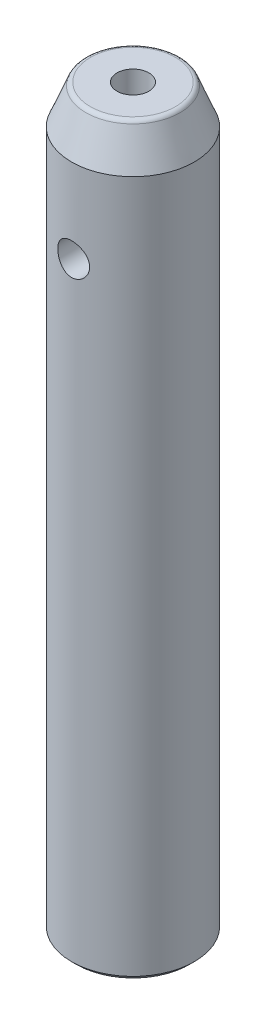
ISO-10303-21;
HEADER;
FILE_DESCRIPTION(('STEP AP214'),'2;1');
FILE_NAME('part.step','',(''),(''),'','','');
FILE_SCHEMA(('AUTOMOTIVE_DESIGN { 1 0 10303 214 1 1 1 1 }'));
ENDSEC;
DATA;
#1=APPLICATION_CONTEXT('core data for automotive mechanical design processes');
#2=APPLICATION_PROTOCOL_DEFINITION('international standard','automotive_design',2000,#1);
#3=PRODUCT_CONTEXT('',#1,'mechanical');
#4=PRODUCT('Part','Part','',(#3));
#5=PRODUCT_RELATED_PRODUCT_CATEGORY('part','',(#4));
#6=PRODUCT_DEFINITION_FORMATION('','',#4);
#7=PRODUCT_DEFINITION_CONTEXT('part definition',#1,'design');
#8=PRODUCT_DEFINITION('design','',#6,#7);
#9=PRODUCT_DEFINITION_SHAPE('','',#8);
#10=(LENGTH_UNIT() NAMED_UNIT(*) SI_UNIT(.MILLI.,.METRE.));
#11=(NAMED_UNIT(*) PLANE_ANGLE_UNIT() SI_UNIT($,.RADIAN.));
#12=(NAMED_UNIT(*) SI_UNIT($,.STERADIAN.) SOLID_ANGLE_UNIT());
#13=UNCERTAINTY_MEASURE_WITH_UNIT(LENGTH_MEASURE(1.E-05),#10,'distance_accuracy_value','');
#14=(GEOMETRIC_REPRESENTATION_CONTEXT(3) GLOBAL_UNCERTAINTY_ASSIGNED_CONTEXT((#13)) GLOBAL_UNIT_ASSIGNED_CONTEXT((#10,
#11,#12)) REPRESENTATION_CONTEXT('',''));
#15=CARTESIAN_POINT('',(0.,0.,0.));
#16=DIRECTION('',(0.,0.,1.));
#17=DIRECTION('',(1.,0.,0.));
#18=AXIS2_PLACEMENT_3D('',#15,#16,#17);
#19=CARTESIAN_POINT('',(0.,76.2,0.));
#20=DIRECTION('',(0.,-1.,0.));
#21=DIRECTION('',(0.,0.,-1.));
#22=AXIS2_PLACEMENT_3D('',#19,#20,#21);
#23=CYLINDRICAL_SURFACE('',#22,6.35);
#24=CARTESIAN_POINT('',(0.,65.15,-6.35));
#25=CARTESIAN_POINT('',(-0.0910448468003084,65.1499976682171,-6.34999855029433));
#26=CARTESIAN_POINT('',(-0.182115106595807,65.1424390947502,-6.34802256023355));
#27=CARTESIAN_POINT('',(-0.361637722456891,65.112454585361,-6.34033166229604));
#28=CARTESIAN_POINT('',(-0.450088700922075,65.090020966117,-6.33461482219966));
#29=CARTESIAN_POINT('',(-0.621755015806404,65.0310607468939,-6.32007407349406));
#30=CARTESIAN_POINT('',(-0.704976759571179,64.9945518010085,-6.3112540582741));
#31=CARTESIAN_POINT('',(-0.864115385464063,64.9085413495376,-6.29144207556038));
#32=CARTESIAN_POINT('',(-0.940031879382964,64.8590391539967,-6.28044999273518));
#33=CARTESIAN_POINT('',(-1.08408361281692,64.7472915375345,-6.25721162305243));
#34=CARTESIAN_POINT('',(-1.1520343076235,64.6848124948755,-6.2449447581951));
#35=CARTESIAN_POINT('',(-1.27662045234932,64.5493844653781,-6.22067339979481));
#36=CARTESIAN_POINT('',(-1.33325452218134,64.4764342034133,-6.20866893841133));
#37=CARTESIAN_POINT('',(-1.43448627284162,64.3206782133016,-6.18607236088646));
#38=CARTESIAN_POINT('',(-1.47887409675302,64.2377319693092,-6.17550627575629));
#39=CARTESIAN_POINT('',(-1.55300255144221,64.0652354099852,-6.15728432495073));
#40=CARTESIAN_POINT('',(-1.58274573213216,63.9756862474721,-6.14962795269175));
#41=CARTESIAN_POINT('',(-1.62610440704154,63.7945636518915,-6.13830437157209));
#42=CARTESIAN_POINT('',(-1.6400533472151,63.7030753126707,-6.13455482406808));
#43=CARTESIAN_POINT('',(-1.65246676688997,63.5189861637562,-6.13122323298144));
#44=CARTESIAN_POINT('',(-1.65093398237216,63.4263855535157,-6.13164045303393));
#45=CARTESIAN_POINT('',(-1.63269273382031,63.2452833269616,-6.13652142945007));
#46=CARTESIAN_POINT('',(-1.61638516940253,63.1567379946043,-6.14087828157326));
#47=CARTESIAN_POINT('',(-1.56969829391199,62.9836852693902,-6.15297677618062));
#48=CARTESIAN_POINT('',(-1.53931790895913,62.8991781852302,-6.16071867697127));
#49=CARTESIAN_POINT('',(-1.46501490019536,62.735543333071,-6.17881066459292));
#50=CARTESIAN_POINT('',(-1.42094967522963,62.6564834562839,-6.18918799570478));
#51=CARTESIAN_POINT('',(-1.32062741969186,62.5067381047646,-6.2113666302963));
#52=CARTESIAN_POINT('',(-1.26436809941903,62.4360542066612,-6.22316820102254));
#53=CARTESIAN_POINT('',(-1.13919365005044,62.3027738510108,-6.2473127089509));
#54=CARTESIAN_POINT('',(-1.06994116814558,62.240494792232,-6.2596611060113));
#55=CARTESIAN_POINT('',(-0.921825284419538,62.1283711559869,-6.28318013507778));
#56=CARTESIAN_POINT('',(-0.842961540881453,62.0785270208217,-6.294350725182));
#57=CARTESIAN_POINT('',(-0.677386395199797,61.9925581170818,-6.31431860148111));
#58=CARTESIAN_POINT('',(-0.590645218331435,61.9564883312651,-6.32310633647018));
#59=CARTESIAN_POINT('',(-0.412050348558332,61.8995330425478,-6.33724917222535));
#60=CARTESIAN_POINT('',(-0.320197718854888,61.8786443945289,-6.34260498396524));
#61=CARTESIAN_POINT('',(-0.136698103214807,61.8531370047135,-6.34917395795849));
#62=CARTESIAN_POINT('',(-0.0451149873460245,61.8480864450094,-6.35049704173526));
#63=CARTESIAN_POINT('',(0.137588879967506,61.853209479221,-6.34916628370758));
#64=CARTESIAN_POINT('',(0.22870967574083,61.8633815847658,-6.34651283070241));
#65=CARTESIAN_POINT('',(0.406378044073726,61.8983062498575,-6.33759791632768));
#66=CARTESIAN_POINT('',(0.492975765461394,61.9228201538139,-6.33139554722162));
#67=CARTESIAN_POINT('',(0.660823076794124,61.985457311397,-6.31608436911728));
#68=CARTESIAN_POINT('',(0.742072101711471,62.0235820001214,-6.30697525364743));
#69=CARTESIAN_POINT('',(0.898610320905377,62.1131743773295,-6.28660102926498));
#70=CARTESIAN_POINT('',(0.973758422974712,62.1648798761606,-6.27529854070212));
#71=CARTESIAN_POINT('',(1.11446374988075,62.2798651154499,-6.25184511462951));
#72=CARTESIAN_POINT('',(1.18001917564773,62.3431470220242,-6.23969401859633));
#73=CARTESIAN_POINT('',(1.30148131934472,62.4814998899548,-6.21551205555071));
#74=CARTESIAN_POINT('',(1.3570840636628,62.5568402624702,-6.20349303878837));
#75=CARTESIAN_POINT('',(1.45486120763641,62.7160338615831,-6.18129455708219));
#76=CARTESIAN_POINT('',(1.49703618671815,62.7998867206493,-6.17111501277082));
#77=CARTESIAN_POINT('',(1.56644342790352,62.9732909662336,-6.1538633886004));
#78=CARTESIAN_POINT('',(1.59376344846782,63.0628053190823,-6.14677310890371));
#79=CARTESIAN_POINT('',(1.63290364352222,63.2453713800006,-6.13649272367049));
#80=CARTESIAN_POINT('',(1.64472753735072,63.3384222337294,-6.13330168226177));
#81=CARTESIAN_POINT('',(1.65233394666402,63.5223158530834,-6.13125643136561));
#82=CARTESIAN_POINT('',(1.64860385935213,63.6131373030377,-6.13227044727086));
#83=CARTESIAN_POINT('',(1.62633248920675,63.7928083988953,-6.13821413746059));
#84=CARTESIAN_POINT('',(1.60779155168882,63.8816580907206,-6.14314372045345));
#85=CARTESIAN_POINT('',(1.55670066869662,64.0542849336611,-6.15628671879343));
#86=CARTESIAN_POINT('',(1.52424906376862,64.1380930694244,-6.16447705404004));
#87=CARTESIAN_POINT('',(1.44633487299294,64.2991372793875,-6.18322034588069));
#88=CARTESIAN_POINT('',(1.40087034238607,64.3763723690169,-6.1937736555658));
#89=CARTESIAN_POINT('',(1.2967225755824,64.5244165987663,-6.2164235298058));
#90=CARTESIAN_POINT('',(1.23770439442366,64.5949847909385,-6.22855507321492));
#91=CARTESIAN_POINT('',(1.10876820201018,64.7253743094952,-6.25279366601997));
#92=CARTESIAN_POINT('',(1.03884757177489,64.7851930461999,-6.26490070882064));
#93=CARTESIAN_POINT('',(0.888403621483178,64.8935578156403,-6.28801547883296));
#94=CARTESIAN_POINT('',(0.807696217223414,64.9418544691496,-6.29899637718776));
#95=CARTESIAN_POINT('',(0.639026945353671,65.0241179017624,-6.31833266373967));
#96=CARTESIAN_POINT('',(0.551070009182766,65.0580943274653,-6.32668981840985));
#97=CARTESIAN_POINT('',(0.38613908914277,65.1060647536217,-6.33869137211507));
#98=CARTESIAN_POINT('',(0.309908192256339,65.1225033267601,-6.3429019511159));
#99=CARTESIAN_POINT('',(0.155790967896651,65.1444714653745,-6.34855676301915));
#100=CARTESIAN_POINT('',(0.0779047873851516,65.150001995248,-6.35000124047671));
#101=CARTESIAN_POINT('',(0.,65.15,-6.35));
#102=B_SPLINE_CURVE_WITH_KNOTS('',3,(#24,#25,#26,#27,#28,#29,#30,#31,#32,#33,#34,#35,#36,#37,
#38,#39,#40,#41,#42,#43,#44,#45,#46,#47,#48,#49,#50,#51,#52,#53,#54,#55,#56,#57,#58,#59,#60,#61,
#62,#63,#64,#65,#66,#67,#68,#69,#70,#71,#72,#73,#74,#75,#76,#77,#78,#79,#80,#81,#82,#83,#84,#85,
#86,#87,#88,#89,#90,#91,#92,#93,#94,#95,#96,#97,#98,#99,#100,#101),.UNSPECIFIED.,.T.,.F.,(4,2,2,
2,2,2,2,2,2,2,2,2,2,2,2,2,2,2,2,2,2,2,2,2,2,2,2,2,2,2,2,2,2,2,2,2,2,2,4),(0.,0.272848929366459,
0.545838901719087,0.818487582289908,1.09115074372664,1.36923066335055,1.64734447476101,
1.92996381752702,2.2125339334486,2.48902023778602,2.76545768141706,3.03461179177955,
3.30378644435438,3.57586585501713,3.847996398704,4.12853593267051,4.4090854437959,
4.69074339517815,4.97234297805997,5.24619498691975,5.52002022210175,5.7894134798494,
6.05883515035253,6.33333182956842,6.60787992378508,6.88975050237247,7.17160891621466,
7.45178358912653,7.73189100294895,8.00328805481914,8.27467877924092,8.54418177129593,
8.81372506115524,9.09082731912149,9.36799624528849,9.65070850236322,9.93323000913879,
10.1667206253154,10.4001905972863),.UNSPECIFIED.);
#103=CARTESIAN_POINT('',(0.,65.15,-6.35));
#104=VERTEX_POINT('',#103);
#105=EDGE_CURVE('E71',#104,#104,#102,.T.);
#106=ORIENTED_EDGE('',*,*,#105,.T.);
#107=EDGE_LOOP('',(#106));
#108=FACE_BOUND('',#107,.T.);
#109=CARTESIAN_POINT('',(1.65,63.5,6.13188388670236));
#110=CARTESIAN_POINT('',(1.64999763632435,63.4090136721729,6.13188553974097));
#111=CARTESIAN_POINT('',(1.64244844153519,63.3180018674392,6.1339311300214));
#112=CARTESIAN_POINT('',(1.61250455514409,63.1386004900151,6.14186949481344));
#113=CARTESIAN_POINT('',(1.5901019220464,63.0502123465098,6.14776432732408));
#114=CARTESIAN_POINT('',(1.53123224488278,62.8786793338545,6.16268948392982));
#115=CARTESIAN_POINT('',(1.49478429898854,62.7955275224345,6.17171554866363));
#116=CARTESIAN_POINT('',(1.40891777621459,62.6365074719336,6.19188078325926));
#117=CARTESIAN_POINT('',(1.35949838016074,62.560639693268,6.20302008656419));
#118=CARTESIAN_POINT('',(1.24783688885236,62.41653888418,6.22645310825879));
#119=CARTESIAN_POINT('',(1.18534252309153,62.3485044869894,6.23876646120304));
#120=CARTESIAN_POINT('',(1.04984797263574,62.2237551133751,6.26299035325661));
#121=CARTESIAN_POINT('',(0.97684674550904,62.1670412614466,6.27490085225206));
#122=CARTESIAN_POINT('',(0.821040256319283,62.0657210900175,6.29719537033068));
#123=CARTESIAN_POINT('',(0.738103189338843,62.0213112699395,6.30755352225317));
#124=CARTESIAN_POINT('',(0.565626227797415,61.9471396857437,6.3253515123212));
#125=CARTESIAN_POINT('',(0.47608739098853,61.9173755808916,6.33279181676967));
#126=CARTESIAN_POINT('',(0.295020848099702,61.8739804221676,6.34377696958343));
#127=CARTESIAN_POINT('',(0.203579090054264,61.8600117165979,6.34740322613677));
#128=CARTESIAN_POINT('',(0.0195829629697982,61.8475425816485,6.35063594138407));
#129=CARTESIAN_POINT('',(-0.0729712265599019,61.8490396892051,6.35024304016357));
#130=CARTESIAN_POINT('',(-0.254218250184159,61.8672197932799,6.34554175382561));
#131=CARTESIAN_POINT('',(-0.342950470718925,61.8835381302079,6.34132739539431));
#132=CARTESIAN_POINT('',(-0.51637116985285,61.9303095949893,6.32956706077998));
#133=CARTESIAN_POINT('',(-0.601059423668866,61.9607635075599,6.32202089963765));
#134=CARTESIAN_POINT('',(-0.764931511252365,62.0352275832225,6.30430356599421));
#135=CARTESIAN_POINT('',(-0.844054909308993,62.0793646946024,6.29410796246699));
#136=CARTESIAN_POINT('',(-0.993897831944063,62.179845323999,6.27219339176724));
#137=CARTESIAN_POINT('',(-1.0646157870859,62.2361911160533,6.26047414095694));
#138=CARTESIAN_POINT('',(-1.1978163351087,62.3614334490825,6.23638166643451));
#139=CARTESIAN_POINT('',(-1.25999831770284,62.430648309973,6.22399933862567));
#140=CARTESIAN_POINT('',(-1.37194316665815,62.5786523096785,6.20028671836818));
#141=CARTESIAN_POINT('',(-1.42170535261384,62.6574419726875,6.1889564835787));
#142=CARTESIAN_POINT('',(-1.50761156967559,62.822984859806,6.16859596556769));
#143=CARTESIAN_POINT('',(-1.54367780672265,62.9097801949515,6.15957891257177));
#144=CARTESIAN_POINT('',(-1.60061006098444,63.0884943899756,6.14503216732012));
#145=CARTESIAN_POINT('',(-1.62147963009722,63.18041204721,6.139501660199));
#146=CARTESIAN_POINT('',(-1.64691605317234,63.3639600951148,6.13272673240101));
#147=CARTESIAN_POINT('',(-1.65192968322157,63.4555243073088,6.13136488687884));
#148=CARTESIAN_POINT('',(-1.6467396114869,63.6381820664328,6.13276088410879));
#149=CARTESIAN_POINT('',(-1.63653743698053,63.72927565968,6.13551831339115));
#150=CARTESIAN_POINT('',(-1.60159835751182,63.9067111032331,6.14472911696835));
#151=CARTESIAN_POINT('',(-1.57712648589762,63.9931089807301,6.15111504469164));
#152=CARTESIAN_POINT('',(-1.51463894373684,64.1605749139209,6.16679819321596));
#153=CARTESIAN_POINT('',(-1.47662157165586,64.2416422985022,6.17609577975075));
#154=CARTESIAN_POINT('',(-1.38720350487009,64.3980251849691,6.19679824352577));
#155=CARTESIAN_POINT('',(-1.33553846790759,64.4731841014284,6.20824328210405));
#156=CARTESIAN_POINT('',(-1.22062204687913,64.6139295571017,6.23185492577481));
#157=CARTESIAN_POINT('',(-1.15736859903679,64.6795143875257,6.24402165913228));
#158=CARTESIAN_POINT('',(-1.01901104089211,64.8010858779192,6.26810744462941));
#159=CARTESIAN_POINT('',(-0.94363079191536,64.8567620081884,6.28001069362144));
#160=CARTESIAN_POINT('',(-0.784333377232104,64.9546682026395,6.3018866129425));
#161=CARTESIAN_POINT('',(-0.700416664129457,64.9968989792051,6.31185938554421));
#162=CARTESIAN_POINT('',(-0.52701661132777,65.0663359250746,6.3286868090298));
#163=CARTESIAN_POINT('',(-0.437579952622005,65.0936528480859,6.33556437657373));
#164=CARTESIAN_POINT('',(-0.255181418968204,65.1328129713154,6.34552712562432));
#165=CARTESIAN_POINT('',(-0.162220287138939,65.1446594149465,6.34861310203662));
#166=CARTESIAN_POINT('',(0.0216806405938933,65.1523476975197,6.35060954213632));
#167=CARTESIAN_POINT('',(0.112600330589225,65.148646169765,6.34963914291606));
#168=CARTESIAN_POINT('',(0.292475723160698,65.126397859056,6.34389911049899));
#169=CARTESIAN_POINT('',(0.381431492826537,65.1078515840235,6.33912960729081));
#170=CARTESIAN_POINT('',(0.554334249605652,65.0566930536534,6.32634877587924));
#171=CARTESIAN_POINT('',(0.638309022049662,65.0241692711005,6.31835785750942));
#172=CARTESIAN_POINT('',(0.799657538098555,64.9460583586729,6.29997214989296));
#173=CARTESIAN_POINT('',(0.877030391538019,64.900469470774,6.2895770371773));
#174=CARTESIAN_POINT('',(1.02512119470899,64.7961626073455,6.26716709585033));
#175=CARTESIAN_POINT('',(1.09561856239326,64.7371389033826,6.25511766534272));
#176=CARTESIAN_POINT('',(1.22586275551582,64.6082234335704,6.23090349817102));
#177=CARTESIAN_POINT('',(1.28560679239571,64.5383288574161,6.21873873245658));
#178=CARTESIAN_POINT('',(1.39386165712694,64.3879245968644,6.19538429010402));
#179=CARTESIAN_POINT('',(1.44211599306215,64.3072260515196,6.18421983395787));
#180=CARTESIAN_POINT('',(1.52430254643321,64.1385820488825,6.16447892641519));
#181=CARTESIAN_POINT('',(1.55824457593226,64.0506416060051,6.15590070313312));
#182=CARTESIAN_POINT('',(1.60614388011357,63.8857937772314,6.14355741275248));
#183=CARTESIAN_POINT('',(1.62255248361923,63.8096329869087,6.13921421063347));
#184=CARTESIAN_POINT('',(1.64448100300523,63.6556542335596,6.13337688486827));
#185=CARTESIAN_POINT('',(1.6500020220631,63.5778364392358,6.13188247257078));
#186=CARTESIAN_POINT('',(1.65,63.5,6.13188388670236));
#187=B_SPLINE_CURVE_WITH_KNOTS('',3,(#109,#110,#111,#112,#113,#114,#115,#116,#117,#118,#119,
#120,#121,#122,#123,#124,#125,#126,#127,#128,#129,#130,#131,#132,#133,#134,#135,#136,#137,#138,
#139,#140,#141,#142,#143,#144,#145,#146,#147,#148,#149,#150,#151,#152,#153,#154,#155,#156,#157,
#158,#159,#160,#161,#162,#163,#164,#165,#166,#167,#168,#169,#170,#171,#172,#173,#174,#175,#176,
#177,#178,#179,#180,#181,#182,#183,#184,#185,#186),.UNSPECIFIED.,.T.,.F.,(4,2,2,2,2,2,2,2,2,2,2,
2,2,2,2,2,2,2,2,2,2,2,2,2,2,2,2,2,2,2,2,2,2,2,2,2,2,2,4),(0.,0.272672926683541,
0.545491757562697,0.817940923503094,1.09040729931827,1.36871710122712,1.64705453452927,
1.92960985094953,2.21211999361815,2.48846958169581,2.76477515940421,3.03446142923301,
3.30416267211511,3.57644504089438,3.84877816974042,4.12905991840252,4.40935701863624,
4.69122322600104,4.97302353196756,5.24680930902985,5.52056760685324,5.78939636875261,
6.05825891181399,6.33276889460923,6.6073278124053,6.8893742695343,7.17140578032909,
7.4513133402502,7.73116220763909,8.00285046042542,8.27452941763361,8.5445134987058,
8.81453392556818,9.09145439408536,9.36844657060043,9.65113942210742,9.93363815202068,
10.1669263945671,10.400190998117),.UNSPECIFIED.);
#188=CARTESIAN_POINT('',(1.65,63.5,6.13188388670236));
#189=VERTEX_POINT('',#188);
#190=EDGE_CURVE('E120',#189,#189,#187,.T.);
#191=ORIENTED_EDGE('',*,*,#190,.T.);
#192=EDGE_LOOP('',(#191));
#193=FACE_BOUND('',#192,.T.);
#194=CARTESIAN_POINT('',(0.,0.50000000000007,0.));
#195=DIRECTION('',(0.,1.,0.));
#196=DIRECTION('',(0.,0.,1.));
#197=AXIS2_PLACEMENT_3D('',#194,#195,#196);
#198=CIRCLE('',#197,6.35);
#199=CARTESIAN_POINT('',(0.,0.50000000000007,6.35));
#200=VERTEX_POINT('',#199);
#201=EDGE_CURVE('E51',#200,#200,#198,.T.);
#202=ORIENTED_EDGE('',*,*,#201,.T.);
#203=EDGE_LOOP('',(#202));
#204=FACE_BOUND('',#203,.T.);
#205=CARTESIAN_POINT('',(0.,72.2000000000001,0.));
#206=DIRECTION('',(0.,1.,0.));
#207=DIRECTION('',(0.,0.,1.));
#208=AXIS2_PLACEMENT_3D('',#205,#206,#207);
#209=CIRCLE('',#208,6.35);
#210=CARTESIAN_POINT('',(0.,72.2000000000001,6.35));
#211=VERTEX_POINT('',#210);
#212=EDGE_CURVE('E77',#211,#211,#209,.F.);
#213=ORIENTED_EDGE('',*,*,#212,.T.);
#214=EDGE_LOOP('',(#213));
#215=FACE_BOUND('',#214,.T.);
#216=ADVANCED_FACE('F39',(#108,#193,#204,#215),#23,.T.);
#217=CARTESIAN_POINT('',(0.,76.2,0.));
#218=DIRECTION('',(0.,1.,0.));
#219=DIRECTION('',(0.,0.,1.));
#220=AXIS2_PLACEMENT_3D('',#217,#218,#219);
#221=PLANE('',#220);
#222=CARTESIAN_POINT('',(0.,76.2,0.));
#223=DIRECTION('',(0.,1.,0.));
#224=DIRECTION('',(0.,0.,1.));
#225=AXIS2_PLACEMENT_3D('',#222,#223,#224);
#226=CIRCLE('',#225,4.41148351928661);
#227=CARTESIAN_POINT('',(0.,76.2,4.41148351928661));
#228=VERTEX_POINT('',#227);
#229=EDGE_CURVE('E80',#228,#228,#226,.T.);
#230=ORIENTED_EDGE('',*,*,#229,.T.);
#231=EDGE_LOOP('',(#230));
#232=FACE_BOUND('',#231,.T.);
#233=CARTESIAN_POINT('',(0.,76.2,0.));
#234=DIRECTION('',(0.,1.,0.));
#235=DIRECTION('',(0.,0.,1.));
#236=AXIS2_PLACEMENT_3D('',#233,#234,#235);
#237=CIRCLE('',#236,1.65);
#238=CARTESIAN_POINT('',(0.,76.2,1.65));
#239=VERTEX_POINT('',#238);
#240=EDGE_CURVE('E64',#239,#239,#237,.T.);
#241=ORIENTED_EDGE('',*,*,#240,.F.);
#242=EDGE_LOOP('',(#241));
#243=FACE_BOUND('',#242,.T.);
#244=ADVANCED_FACE('F104',(#232,#243),#221,.T.);
#245=CARTESIAN_POINT('',(0.,0.,0.));
#246=DIRECTION('',(0.,1.,0.));
#247=DIRECTION('',(0.,0.,1.));
#248=AXIS2_PLACEMENT_3D('',#245,#246,#247);
#249=PLANE('',#248);
#250=CARTESIAN_POINT('',(0.,0.,0.));
#251=DIRECTION('',(0.,1.,0.));
#252=DIRECTION('',(0.,0.,1.));
#253=AXIS2_PLACEMENT_3D('',#250,#251,#252);
#254=CIRCLE('',#253,5.84999999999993);
#255=CARTESIAN_POINT('',(0.,0.,5.84999999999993));
#256=VERTEX_POINT('',#255);
#257=EDGE_CURVE('E11',#256,#256,#254,.F.);
#258=ORIENTED_EDGE('',*,*,#257,.T.);
#259=EDGE_LOOP('',(#258));
#260=FACE_BOUND('',#259,.T.);
#261=CARTESIAN_POINT('',(0.,0.,0.));
#262=DIRECTION('',(0.,-1.,0.));
#263=DIRECTION('',(0.,0.,-1.));
#264=AXIS2_PLACEMENT_3D('',#261,#262,#263);
#265=CIRCLE('',#264,2.5);
#266=CARTESIAN_POINT('',(0.,0.,-2.5));
#267=VERTEX_POINT('',#266);
#268=EDGE_CURVE('E65',#267,#267,#265,.T.);
#269=ORIENTED_EDGE('',*,*,#268,.F.);
#270=EDGE_LOOP('',(#269));
#271=FACE_BOUND('',#270,.T.);
#272=ADVANCED_FACE('F110',(#260,#271),#249,.F.);
#273=CARTESIAN_POINT('',(0.,66.1,0.));
#274=DIRECTION('',(0.,1.,0.));
#275=DIRECTION('',(0.,0.,1.));
#276=AXIS2_PLACEMENT_3D('',#273,#274,#275);
#277=CONICAL_SURFACE('',#276,1.65,1.02974425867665);
#278=CARTESIAN_POINT('',(-0.0573261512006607,65.1490038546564,-0.035211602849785));
#279=CARTESIAN_POINT('',(-0.0554022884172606,65.149070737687,-0.0385561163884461));
#280=CARTESIAN_POINT('',(-0.0531981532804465,65.1491440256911,-0.0417422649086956));
#281=CARTESIAN_POINT('',(-0.0482828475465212,65.1492952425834,-0.0477003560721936));
#282=CARTESIAN_POINT('',(-0.0455711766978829,65.1493731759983,-0.0504718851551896));
#283=CARTESIAN_POINT('',(-0.0397197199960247,65.1495244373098,-0.0555035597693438));
#284=CARTESIAN_POINT('',(-0.0365810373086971,65.149597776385,-0.0577649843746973));
#285=CARTESIAN_POINT('',(-0.0299586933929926,65.1497313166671,-0.0617075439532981));
#286=CARTESIAN_POINT('',(-0.0264751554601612,65.1497915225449,-0.0633888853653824));
#287=CARTESIAN_POINT('',(-0.0193829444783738,65.1498898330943,-0.0660675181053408));
#288=CARTESIAN_POINT('',(-0.0157819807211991,65.1499285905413,-0.0670852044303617));
#289=CARTESIAN_POINT('',(-0.0084584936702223,65.1499823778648,-0.0684855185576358));
#290=CARTESIAN_POINT('',(-0.00473598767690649,65.1499974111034,-0.0688682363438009));
#291=CARTESIAN_POINT('',(0.00263034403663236,65.1500019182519,-0.0689835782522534));
#292=CARTESIAN_POINT('',(0.00627394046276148,65.1499919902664,-0.0687314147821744));
#293=CARTESIAN_POINT('',(0.0134664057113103,65.1499489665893,-0.0676177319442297));
#294=CARTESIAN_POINT('',(0.0170152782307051,65.1499158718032,-0.0667562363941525));
#295=CARTESIAN_POINT('',(0.0239114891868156,65.1498303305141,-0.0644556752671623));
#296=CARTESIAN_POINT('',(0.0272592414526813,65.1497779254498,-0.0630178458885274));
#297=CARTESIAN_POINT('',(0.0336722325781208,65.1496595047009,-0.0596113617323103));
#298=CARTESIAN_POINT('',(0.0367374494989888,65.1495934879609,-0.0576426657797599));
#299=CARTESIAN_POINT('',(0.0425655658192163,65.1494535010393,-0.0531908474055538));
#300=CARTESIAN_POINT('',(0.045321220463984,65.1493793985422,-0.0506982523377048));
#301=CARTESIAN_POINT('',(0.0503905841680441,65.149232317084,-0.0452983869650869));
#302=CARTESIAN_POINT('',(0.0527042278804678,65.1491593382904,-0.0423910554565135));
#303=CARTESIAN_POINT('',(0.0569012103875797,65.1490199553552,-0.0361466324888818));
#304=CARTESIAN_POINT('',(0.0587687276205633,65.1489538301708,-0.0327989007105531));
#305=CARTESIAN_POINT('',(0.0619336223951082,65.1488379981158,-0.0258437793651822));
#306=CARTESIAN_POINT('',(0.0632309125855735,65.1487882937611,-0.0222363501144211));
#307=CARTESIAN_POINT('',(0.0652553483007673,65.1487094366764,-0.0147526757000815));
#308=CARTESIAN_POINT('',(0.0659649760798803,65.1486809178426,-0.0108716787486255));
#309=CARTESIAN_POINT('',(0.0667340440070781,65.1486499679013,-0.00304555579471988));
#310=CARTESIAN_POINT('',(0.0667934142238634,65.1486475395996,0.000899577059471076));
#311=CARTESIAN_POINT('',(0.0662563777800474,65.1486692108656,0.00880601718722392));
#312=CARTESIAN_POINT('',(0.0656498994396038,65.1486937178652,0.0127666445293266));
#313=CARTESIAN_POINT('',(0.0637790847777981,65.148767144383,0.0205294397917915));
#314=CARTESIAN_POINT('',(0.0625147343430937,65.1488160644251,0.0243316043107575));
#315=CARTESIAN_POINT('',(0.059363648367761,65.1489325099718,0.0316538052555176));
#316=CARTESIAN_POINT('',(0.0574789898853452,65.1489999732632,0.0351747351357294));
#317=CARTESIAN_POINT('',(0.0531330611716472,65.1491457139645,0.0418408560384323));
#318=CARTESIAN_POINT('',(0.0506718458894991,65.1492239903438,0.0449860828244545));
#319=CARTESIAN_POINT('',(0.0452966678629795,65.1493802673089,0.0507363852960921));
#320=CARTESIAN_POINT('',(0.0423935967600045,65.1494582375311,0.0533516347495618));
#321=CARTESIAN_POINT('',(0.0361768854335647,65.1496062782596,0.0580380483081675));
#322=CARTESIAN_POINT('',(0.0328633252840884,65.1496763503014,0.0601093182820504));
#323=CARTESIAN_POINT('',(0.0260345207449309,65.1497980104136,0.063577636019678));
#324=CARTESIAN_POINT('',(0.0225292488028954,65.1498501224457,0.0649943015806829));
#325=CARTESIAN_POINT('',(0.0153262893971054,65.1499327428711,0.0671998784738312));
#326=CARTESIAN_POINT('',(0.0116286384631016,65.1499632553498,0.0679889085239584));
#327=CARTESIAN_POINT('',(0.00425845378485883,65.1499985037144,0.0688976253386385));
#328=CARTESIAN_POINT('',(0.00058817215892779,65.1500039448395,0.0690356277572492));
#329=CARTESIAN_POINT('',(-0.00672239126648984,65.1499903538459,0.0686873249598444));
#330=CARTESIAN_POINT('',(-0.0103626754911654,65.1499713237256,0.068201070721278));
#331=CARTESIAN_POINT('',(-0.0174742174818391,65.1499112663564,0.0666289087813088));
#332=CARTESIAN_POINT('',(-0.0209467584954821,65.1498704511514,0.0655487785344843));
#333=CARTESIAN_POINT('',(-0.0276647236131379,65.1497714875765,0.0628288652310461));
#334=CARTESIAN_POINT('',(-0.0309101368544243,65.1497133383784,0.0611890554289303));
#335=CARTESIAN_POINT('',(-0.0371317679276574,65.1495851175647,0.0573756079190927));
#336=CARTESIAN_POINT('',(-0.0401036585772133,65.1495148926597,0.0551949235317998));
#337=CARTESIAN_POINT('',(-0.0456522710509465,65.1493706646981,0.0503787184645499));
#338=CARTESIAN_POINT('',(-0.0482289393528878,65.1492966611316,0.0477431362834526));
#339=CARTESIAN_POINT('',(-0.0529952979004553,65.1491504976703,0.0420098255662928));
#340=CARTESIAN_POINT('',(-0.0551713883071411,65.1490784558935,0.0389007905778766));
#341=CARTESIAN_POINT('',(-0.0589892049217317,65.1489463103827,0.0323703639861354));
#342=CARTESIAN_POINT('',(-0.0606308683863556,65.1488862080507,0.0289489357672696));
#343=CARTESIAN_POINT('',(-0.0633853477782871,65.1487826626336,0.0217771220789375));
#344=CARTESIAN_POINT('',(-0.0644802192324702,65.1487397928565,0.018019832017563));
#345=CARTESIAN_POINT('',(-0.066038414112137,65.1486781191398,0.0103751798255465));
#346=CARTESIAN_POINT('',(-0.0665015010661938,65.1486593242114,0.00648776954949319));
#347=CARTESIAN_POINT('',(-0.0667883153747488,65.1486477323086,-0.00139174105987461));
#348=CARTESIAN_POINT('',(-0.066598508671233,65.1486554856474,-0.00538433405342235));
#349=CARTESIAN_POINT('',(-0.0655536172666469,65.148697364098,-0.0132782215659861));
#350=CARTESIAN_POINT('',(-0.0646992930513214,65.1487314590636,-0.0171796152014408));
#351=CARTESIAN_POINT('',(-0.0627577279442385,65.14880624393,-0.0234565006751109));
#352=CARTESIAN_POINT('',(-0.0618549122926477,65.1488405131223,-0.0258906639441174));
#353=CARTESIAN_POINT('',(-0.0597856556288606,65.1489168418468,-0.0306442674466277));
#354=CARTESIAN_POINT('',(-0.058619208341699,65.1489589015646,-0.0329637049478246));
#355=CARTESIAN_POINT('',(-0.0573261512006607,65.1490038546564,-0.035211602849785));
#356=B_SPLINE_CURVE_WITH_KNOTS('',3,(#278,#279,#280,#281,#282,#283,#284,#285,#286,#287,#288,
#289,#290,#291,#292,#293,#294,#295,#296,#297,#298,#299,#300,#301,#302,#303,#304,#305,#306,#307,
#308,#309,#310,#311,#312,#313,#314,#315,#316,#317,#318,#319,#320,#321,#322,#323,#324,#325,#326,
#327,#328,#329,#330,#331,#332,#333,#334,#335,#336,#337,#338,#339,#340,#341,#342,#343,#344,#345,
#346,#347,#348,#349,#350,#351,#352,#353,#354,#355),.UNSPECIFIED.,.T.,.F.,(4,2,2,2,2,2,2,2,2,2,2,
2,2,2,2,2,2,2,2,2,2,2,2,2,2,2,2,2,2,2,2,2,2,2,2,2,2,2,4),(0.,0.0115675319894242,
0.0231465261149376,0.0346961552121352,0.0462416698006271,0.0574131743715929,0.0685830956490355,
0.079487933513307,0.0903923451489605,0.101273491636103,0.112155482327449,0.123254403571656,
0.134354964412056,0.145804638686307,0.15725606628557,0.16903767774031,0.180820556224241,
0.192784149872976,0.204748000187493,0.216672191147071,0.22859524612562,0.240261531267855,
0.251925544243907,0.263212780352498,0.27449788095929,0.28546351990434,0.296428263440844,
0.307288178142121,0.318148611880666,0.329158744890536,0.340170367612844,0.351505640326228,
0.362842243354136,0.374529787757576,0.386221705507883,0.398157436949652,0.410079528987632,
0.417854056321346,0.425628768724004),.UNSPECIFIED.);
#357=CARTESIAN_POINT('',(-0.0573261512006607,65.1490038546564,-0.035211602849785));
#358=VERTEX_POINT('',#357);
#359=EDGE_CURVE('E43',#358,#358,#356,.T.);
#360=ORIENTED_EDGE('',*,*,#359,.T.);
#361=EDGE_LOOP('',(#360));
#362=FACE_BOUND('',#361,.T.);
#363=CARTESIAN_POINT('',(0.,66.1,0.));
#364=DIRECTION('',(0.,1.,0.));
#365=DIRECTION('',(0.,0.,1.));
#366=AXIS2_PLACEMENT_3D('',#363,#364,#365);
#367=CIRCLE('',#366,1.65);
#368=CARTESIAN_POINT('',(0.,66.1,1.65));
#369=VERTEX_POINT('',#368);
#370=EDGE_CURVE('E68',#369,#369,#367,.T.);
#371=ORIENTED_EDGE('',*,*,#370,.T.);
#372=EDGE_LOOP('',(#371));
#373=FACE_BOUND('',#372,.T.);
#374=ADVANCED_FACE('F132',(#362,#373),#277,.F.);
#375=CARTESIAN_POINT('',(0.,76.2,0.));
#376=DIRECTION('',(0.,1.,0.));
#377=DIRECTION('',(0.,0.,1.));
#378=AXIS2_PLACEMENT_3D('',#375,#376,#377);
#379=CYLINDRICAL_SURFACE('',#378,1.65);
#380=ORIENTED_EDGE('',*,*,#370,.F.);
#381=EDGE_LOOP('',(#380));
#382=FACE_BOUND('',#381,.T.);
#383=ORIENTED_EDGE('',*,*,#240,.T.);
#384=EDGE_LOOP('',(#383));
#385=FACE_BOUND('',#384,.T.);
#386=ADVANCED_FACE('F58',(#382,#385),#379,.F.);
#387=CARTESIAN_POINT('',(0.,11.,0.));
#388=DIRECTION('',(0.,-1.,0.));
#389=DIRECTION('',(0.,0.,-1.));
#390=AXIS2_PLACEMENT_3D('',#387,#388,#389);
#391=CONICAL_SURFACE('',#390,2.5,1.02974425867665);
#392=CARTESIAN_POINT('',(0.,12.5021515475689,0.));
#393=VERTEX_POINT('',#392);
#394=VERTEX_LOOP('',#393);
#395=FACE_BOUND('',#394,.T.);
#396=CARTESIAN_POINT('',(0.,11.,0.));
#397=DIRECTION('',(0.,-1.,0.));
#398=DIRECTION('',(0.,0.,-1.));
#399=AXIS2_PLACEMENT_3D('',#396,#397,#398);
#400=CIRCLE('',#399,2.5);
#401=CARTESIAN_POINT('',(0.,11.,-2.5));
#402=VERTEX_POINT('',#401);
#403=EDGE_CURVE('E62',#402,#402,#400,.T.);
#404=ORIENTED_EDGE('',*,*,#403,.T.);
#405=EDGE_LOOP('',(#404));
#406=FACE_BOUND('',#405,.T.);
#407=ADVANCED_FACE('F54',(#395,#406),#391,.F.);
#408=CARTESIAN_POINT('',(0.,0.,0.));
#409=DIRECTION('',(0.,-1.,0.));
#410=DIRECTION('',(0.,0.,-1.));
#411=AXIS2_PLACEMENT_3D('',#408,#409,#410);
#412=CYLINDRICAL_SURFACE('',#411,2.5);
#413=ORIENTED_EDGE('',*,*,#403,.F.);
#414=EDGE_LOOP('',(#413));
#415=FACE_BOUND('',#414,.T.);
#416=ORIENTED_EDGE('',*,*,#268,.T.);
#417=EDGE_LOOP('',(#416));
#418=FACE_BOUND('',#417,.T.);
#419=ADVANCED_FACE('F57',(#415,#418),#412,.F.);
#420=CARTESIAN_POINT('',(0.,76.2,0.));
#421=DIRECTION('',(0.,-1.,0.));
#422=DIRECTION('',(0.,0.,-1.));
#423=AXIS2_PLACEMENT_3D('',#420,#421,#422);
#424=CONICAL_SURFACE('',#423,4.75000000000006,0.38050637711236);
#425=CARTESIAN_POINT('',(0.,75.885695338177,0.));
#426=DIRECTION('',(0.,1.,0.));
#427=DIRECTION('',(0.,0.,1.));
#428=AXIS2_PLACEMENT_3D('',#425,#426,#427);
#429=CIRCLE('',#428,4.87572186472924);
#430=CARTESIAN_POINT('',(0.,75.885695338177,4.87572186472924));
#431=VERTEX_POINT('',#430);
#432=EDGE_CURVE('E83',#431,#431,#429,.F.);
#433=ORIENTED_EDGE('',*,*,#432,.T.);
#434=EDGE_LOOP('',(#433));
#435=FACE_BOUND('',#434,.T.);
#436=ORIENTED_EDGE('',*,*,#212,.F.);
#437=EDGE_LOOP('',(#436));
#438=FACE_BOUND('',#437,.T.);
#439=ADVANCED_FACE('F100',(#435,#438),#424,.T.);
#440=CARTESIAN_POINT('',(0.,75.7,0.));
#441=DIRECTION('',(0.,1.,0.));
#442=DIRECTION('',(0.,0.,1.));
#443=AXIS2_PLACEMENT_3D('',#440,#441,#442);
#444=TOROIDAL_SURFACE('',#443,4.41148351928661,0.5);
#445=ORIENTED_EDGE('',*,*,#432,.F.);
#446=EDGE_LOOP('',(#445));
#447=FACE_BOUND('',#446,.T.);
#448=ORIENTED_EDGE('',*,*,#229,.F.);
#449=EDGE_LOOP('',(#448));
#450=FACE_BOUND('',#449,.T.);
#451=ADVANCED_FACE('F93',(#447,#450),#444,.T.);
#452=CARTESIAN_POINT('',(0.,0.50000000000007,0.));
#453=DIRECTION('',(0.,1.,0.));
#454=DIRECTION('',(0.,0.,1.));
#455=AXIS2_PLACEMENT_3D('',#452,#453,#454);
#456=CONICAL_SURFACE('',#455,6.35,0.785398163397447);
#457=ORIENTED_EDGE('',*,*,#257,.F.);
#458=EDGE_LOOP('',(#457));
#459=FACE_BOUND('',#458,.T.);
#460=ORIENTED_EDGE('',*,*,#201,.F.);
#461=EDGE_LOOP('',(#460));
#462=FACE_BOUND('',#461,.T.);
#463=ADVANCED_FACE('F41',(#459,#462),#456,.T.);
#464=CARTESIAN_POINT('',(0.,63.5,-6.35));
#465=DIRECTION('',(0.,0.,1.));
#466=DIRECTION('',(1.,0.,0.));
#467=AXIS2_PLACEMENT_3D('',#464,#465,#466);
#468=CYLINDRICAL_SURFACE('',#467,1.65);
#469=ORIENTED_EDGE('',*,*,#359,.F.);
#470=EDGE_LOOP('',(#469));
#471=FACE_BOUND('',#470,.T.);
#472=ORIENTED_EDGE('',*,*,#190,.F.);
#473=EDGE_LOOP('',(#472));
#474=FACE_BOUND('',#473,.T.);
#475=ORIENTED_EDGE('',*,*,#105,.F.);
#476=EDGE_LOOP('',(#475));
#477=FACE_BOUND('',#476,.T.);
#478=ADVANCED_FACE('F92',(#471,#474,#477),#468,.F.);
#479=CLOSED_SHELL('',(#216,#244,#272,#374,#386,#407,#419,#439,#451,#463,#478));
#480=MANIFOLD_SOLID_BREP('B2',#479);
#481=ADVANCED_BREP_SHAPE_REPRESENTATION('',(#18,#480),#14);
#482=SHAPE_DEFINITION_REPRESENTATION(#9,#481);
ENDSEC;
END-ISO-10303-21;
